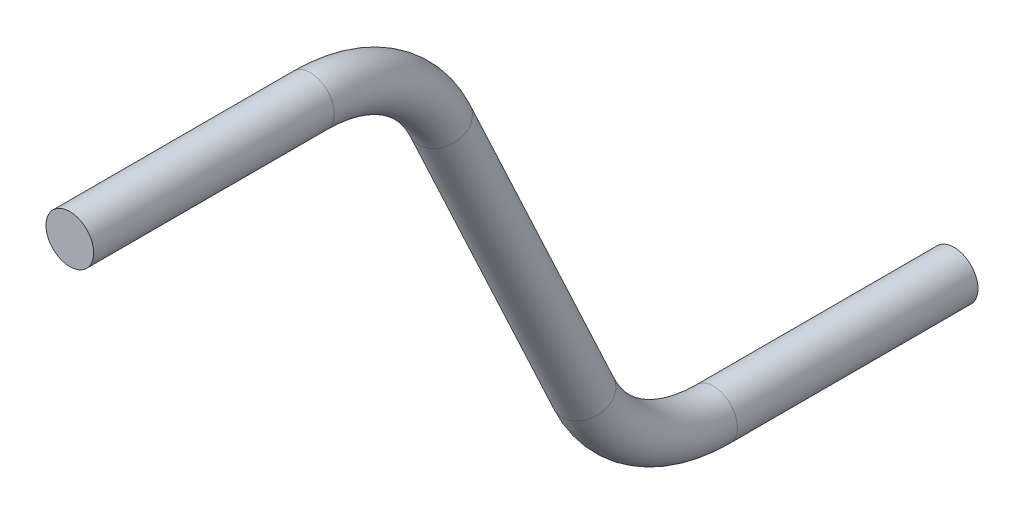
ISO-10303-21;
HEADER;
FILE_DESCRIPTION(('STEP AP214'),'2;1');
FILE_NAME('part.step','',(''),(''),'','','');
FILE_SCHEMA(('AUTOMOTIVE_DESIGN { 1 0 10303 214 1 1 1 1 }'));
ENDSEC;
DATA;
#1=APPLICATION_CONTEXT('core data for automotive mechanical design processes');
#2=APPLICATION_PROTOCOL_DEFINITION('international standard','automotive_design',2000,#1);
#3=PRODUCT_CONTEXT('',#1,'mechanical');
#4=PRODUCT('Part','Part','',(#3));
#5=PRODUCT_RELATED_PRODUCT_CATEGORY('part','',(#4));
#6=PRODUCT_DEFINITION_FORMATION('','',#4);
#7=PRODUCT_DEFINITION_CONTEXT('part definition',#1,'design');
#8=PRODUCT_DEFINITION('design','',#6,#7);
#9=PRODUCT_DEFINITION_SHAPE('','',#8);
#10=(LENGTH_UNIT() NAMED_UNIT(*) SI_UNIT(.MILLI.,.METRE.));
#11=(NAMED_UNIT(*) PLANE_ANGLE_UNIT() SI_UNIT($,.RADIAN.));
#12=(NAMED_UNIT(*) SI_UNIT($,.STERADIAN.) SOLID_ANGLE_UNIT());
#13=UNCERTAINTY_MEASURE_WITH_UNIT(LENGTH_MEASURE(1.E-05),#10,'distance_accuracy_value','');
#14=(GEOMETRIC_REPRESENTATION_CONTEXT(3) GLOBAL_UNCERTAINTY_ASSIGNED_CONTEXT((#13)) GLOBAL_UNIT_ASSIGNED_CONTEXT((#10,
#11,#12)) REPRESENTATION_CONTEXT('',''));
#15=CARTESIAN_POINT('',(0.,0.,0.));
#16=DIRECTION('',(0.,0.,1.));
#17=DIRECTION('',(1.,0.,0.));
#18=AXIS2_PLACEMENT_3D('',#15,#16,#17);
#19=CARTESIAN_POINT('',(0.,0.,16.002));
#20=DIRECTION('',(0.,0.,-1.));
#21=DIRECTION('',(-1.,0.,0.));
#22=AXIS2_PLACEMENT_3D('',#19,#20,#21);
#23=CYLINDRICAL_SURFACE('',#22,1.5875);
#24=CARTESIAN_POINT('',(0.,0.,16.002));
#25=DIRECTION('',(0.,0.,1.));
#26=DIRECTION('',(1.,0.,0.));
#27=AXIS2_PLACEMENT_3D('',#24,#25,#26);
#28=CIRCLE('',#27,1.5875);
#29=CARTESIAN_POINT('',(0.,-1.5875,16.002));
#30=VERTEX_POINT('',#29);
#31=EDGE_CURVE('E10',#30,#30,#28,.T.);
#32=ORIENTED_EDGE('',*,*,#31,.F.);
#33=EDGE_LOOP('',(#32));
#34=FACE_BOUND('',#33,.T.);
#35=CARTESIAN_POINT('',(0.,0.,0.));
#36=DIRECTION('',(0.,0.,1.));
#37=DIRECTION('',(1.,0.,0.));
#38=AXIS2_PLACEMENT_3D('',#35,#36,#37);
#39=CIRCLE('',#38,1.5875);
#40=CARTESIAN_POINT('',(1.5875,0.,0.));
#41=VERTEX_POINT('',#40);
#42=EDGE_CURVE('E39',#41,#41,#39,.T.);
#43=ORIENTED_EDGE('',*,*,#42,.T.);
#44=EDGE_LOOP('',(#43));
#45=FACE_BOUND('',#44,.T.);
#46=ADVANCED_FACE('F33',(#34,#45),#23,.T.);
#47=CARTESIAN_POINT('',(0.,0.,0.));
#48=DIRECTION('',(0.,0.,1.));
#49=DIRECTION('',(1.,0.,0.));
#50=AXIS2_PLACEMENT_3D('',#47,#48,#49);
#51=PLANE('',#50);
#52=ORIENTED_EDGE('',*,*,#42,.F.);
#53=EDGE_LOOP('',(#52));
#54=FACE_BOUND('',#53,.T.);
#55=ADVANCED_FACE('F75',(#54),#51,.F.);
#56=CARTESIAN_POINT('',(0.,31.4675945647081,42.8117687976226));
#57=DIRECTION('',(0.,0.,1.));
#58=DIRECTION('',(0.,-1.,0.));
#59=AXIS2_PLACEMENT_3D('',#56,#57,#58);
#60=CYLINDRICAL_SURFACE('',#59,1.5875);
#61=CARTESIAN_POINT('',(0.,31.4675945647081,42.8117687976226));
#62=DIRECTION('',(0.,0.,1.));
#63=DIRECTION('',(1.,0.,0.));
#64=AXIS2_PLACEMENT_3D('',#61,#62,#63);
#65=CIRCLE('',#64,1.5875);
#66=CARTESIAN_POINT('',(0.,33.0550945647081,42.8117687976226));
#67=VERTEX_POINT('',#66);
#68=EDGE_CURVE('E47',#67,#67,#65,.T.);
#69=ORIENTED_EDGE('',*,*,#68,.T.);
#70=EDGE_LOOP('',(#69));
#71=FACE_BOUND('',#70,.T.);
#72=CARTESIAN_POINT('',(0.,31.4675945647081,58.8137687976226));
#73=DIRECTION('',(0.,0.,1.));
#74=DIRECTION('',(1.,0.,0.));
#75=AXIS2_PLACEMENT_3D('',#72,#73,#74);
#76=CIRCLE('',#75,1.5875);
#77=CARTESIAN_POINT('',(1.5875,31.4675945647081,58.8137687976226));
#78=VERTEX_POINT('',#77);
#79=EDGE_CURVE('E43',#78,#78,#76,.T.);
#80=ORIENTED_EDGE('',*,*,#79,.F.);
#81=EDGE_LOOP('',(#80));
#82=FACE_BOUND('',#81,.T.);
#83=ADVANCED_FACE('F80',(#71,#82),#60,.T.);
#84=CARTESIAN_POINT('',(0.,21.9425945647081,42.8117687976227));
#85=DIRECTION('',(1.,0.,0.));
#86=DIRECTION('',(0.,0.,-1.));
#87=AXIS2_PLACEMENT_3D('',#84,#85,#86);
#88=TOROIDAL_SURFACE('',#87,9.525,1.5875);
#89=CARTESIAN_POINT('',(0.,25.9680335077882,34.1791871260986));
#90=DIRECTION('',(0.,0.906307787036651,0.422618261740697));
#91=DIRECTION('',(1.,0.,0.));
#92=AXIS2_PLACEMENT_3D('',#89,#90,#91);
#93=CIRCLE('',#92,1.5875);
#94=CARTESIAN_POINT('',(0.,26.6389399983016,32.7404235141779));
#95=VERTEX_POINT('',#94);
#96=EDGE_CURVE('E52',#95,#95,#93,.T.);
#97=CARTESIAN_POINT('',(0.,21.9425945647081,42.8117687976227));
#98=DIRECTION('',(1.,0.,0.));
#99=DIRECTION('',(0.,0.,-1.));
#100=AXIS2_PLACEMENT_3D('',#97,#98,#99);
#101=CIRCLE('',#100,11.1125);
#102=EDGE_CURVE('',#95,#67,#101,.T.);
#103=ORIENTED_EDGE('',*,*,#96,.T.);
#104=ORIENTED_EDGE('',*,*,#68,.F.);
#105=ORIENTED_EDGE('',*,*,#102,.T.);
#106=ORIENTED_EDGE('',*,*,#102,.F.);
#107=EDGE_LOOP('',(#103,#105,#104,#106));
#108=FACE_BOUND('',#107,.T.);
#109=ADVANCED_FACE('F72',(#108),#88,.T.);
#110=CARTESIAN_POINT('',(0.,5.49956105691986,24.6345816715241));
#111=DIRECTION('',(0.,0.906307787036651,0.422618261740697));
#112=DIRECTION('',(0.,-0.422618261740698,0.906307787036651));
#113=AXIS2_PLACEMENT_3D('',#110,#111,#112);
#114=CYLINDRICAL_SURFACE('',#113,1.5875);
#115=CARTESIAN_POINT('',(0.,5.49956105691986,24.6345816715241));
#116=DIRECTION('',(0.,0.906307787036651,0.422618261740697));
#117=DIRECTION('',(1.,0.,0.));
#118=AXIS2_PLACEMENT_3D('',#115,#116,#117);
#119=CIRCLE('',#118,1.5875);
#120=CARTESIAN_POINT('',(0.,4.8286545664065,26.0733452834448));
#121=VERTEX_POINT('',#120);
#122=EDGE_CURVE('E55',#121,#121,#119,.T.);
#123=ORIENTED_EDGE('',*,*,#122,.T.);
#124=EDGE_LOOP('',(#123));
#125=FACE_BOUND('',#124,.T.);
#126=ORIENTED_EDGE('',*,*,#96,.F.);
#127=EDGE_LOOP('',(#126));
#128=FACE_BOUND('',#127,.T.);
#129=ADVANCED_FACE('F59',(#125,#128),#114,.T.);
#130=CARTESIAN_POINT('',(0.,9.525,16.002));
#131=DIRECTION('',(1.,0.,0.));
#132=DIRECTION('',(0.,0.,-1.));
#133=AXIS2_PLACEMENT_3D('',#130,#131,#132);
#134=TOROIDAL_SURFACE('',#133,9.525,1.5875);
#135=CARTESIAN_POINT('',(0.,9.525,16.002));
#136=DIRECTION('',(1.,0.,0.));
#137=DIRECTION('',(0.,0.,-1.));
#138=AXIS2_PLACEMENT_3D('',#135,#136,#137);
#139=CIRCLE('',#138,11.1125);
#140=EDGE_CURVE('',#121,#30,#139,.T.);
#141=ORIENTED_EDGE('',*,*,#122,.F.);
#142=ORIENTED_EDGE('',*,*,#31,.T.);
#143=ORIENTED_EDGE('',*,*,#140,.T.);
#144=ORIENTED_EDGE('',*,*,#140,.F.);
#145=EDGE_LOOP('',(#141,#143,#142,#144));
#146=FACE_BOUND('',#145,.T.);
#147=ADVANCED_FACE('F62',(#146),#134,.T.);
#148=CARTESIAN_POINT('',(0.,31.4675945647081,58.8137687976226));
#149=DIRECTION('',(0.,0.,1.));
#150=DIRECTION('',(1.,0.,0.));
#151=AXIS2_PLACEMENT_3D('',#148,#149,#150);
#152=PLANE('',#151);
#153=ORIENTED_EDGE('',*,*,#79,.T.);
#154=EDGE_LOOP('',(#153));
#155=FACE_BOUND('',#154,.T.);
#156=ADVANCED_FACE('F64',(#155),#152,.T.);
#157=CLOSED_SHELL('',(#46,#55,#83,#109,#129,#147,#156));
#158=MANIFOLD_SOLID_BREP('B2',#157);
#159=ADVANCED_BREP_SHAPE_REPRESENTATION('',(#18,#158),#14);
#160=SHAPE_DEFINITION_REPRESENTATION(#9,#159);
ENDSEC;
END-ISO-10303-21;
